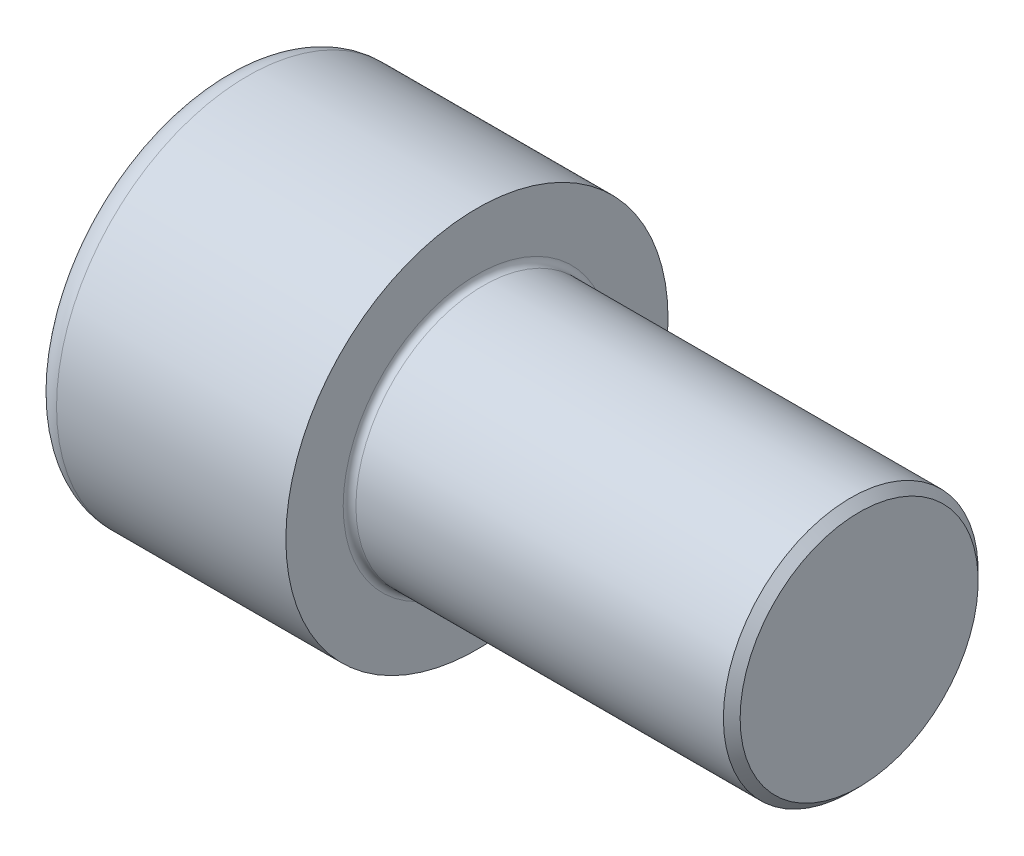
from build123d import *

# Parameters (mm, degrees)
FILLET1_R   = 2.5
FILLET2_R   = 10
HEX_2_DEPTH = 60


with BuildPart() as part:
    # BodySke → Base-Revolve (revolve)
    with BuildSketch(Plane.XY, mode=Mode.PRIVATE) as base_revolve_sk:
        Polygon((0, 0), (0, 75), (100, 75), (100, 50), (246.7125, 50), (250, 46.7125), (250, 0), align=None)
    revolve(base_revolve_sk.sketch.rotate(Axis((-31.75, 0, 0), (1, 0, 0)), 90), axis=Axis((-31.75, 0, 0), (1, 0, 0)))

    # Fillet1
    fillet1_edges = [part.edges().sort_by_distance(p)[0] for p in [
        (100, 0, -50),
    ]]
    fillet(fillet1_edges, radius=FILLET1_R)

    # Fillet2
    fillet2_edges = [part.edges().sort_by_distance(p)[0] for p in [
        (0, 0, -75),
    ]]
    fillet(fillet2_edges, radius=FILLET2_R)

    # Sketch2 → Hex-PreBroach (revolve, cut)
    with BuildSketch(Plane.XY, mode=Mode.PRIVATE) as hex_prebroach_sk:
        Polygon((0, 42.56), (60, 42.56), (84.572027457, 0), (0, 0), align=None)
    revolve(hex_prebroach_sk.sketch.rotate(Axis((0, 0, 0), (1, 0, 0)), 90), axis=Axis((0, 0, 0), (1, 0, 0)), mode=Mode.SUBTRACT)

    # Sketch3 → Hex 2 (cut)
    with BuildSketch(Plane(origin=(0, 0, 0), x_dir=(0, 0.500000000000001, 0.866025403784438), z_dir=(-1, 0, 0))):
        Polygon((24.572027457, 42.56), (-24.572027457, 42.56), (-49.144054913, 0), (-24.572027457, -42.56), (24.572027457, -42.56), (49.144054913, 0), align=None)
    extrude(amount=-HEX_2_DEPTH, mode=Mode.SUBTRACT)


solid = part.part
